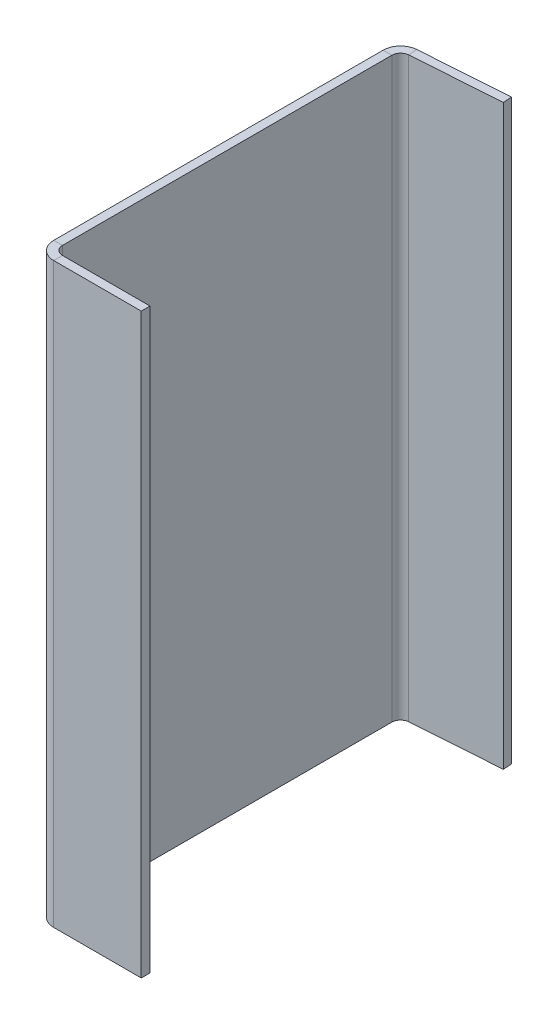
ISO-10303-21;
HEADER;
FILE_DESCRIPTION(('STEP AP214'),'2;1');
FILE_NAME('part.step','',(''),(''),'','','');
FILE_SCHEMA(('AUTOMOTIVE_DESIGN { 1 0 10303 214 1 1 1 1 }'));
ENDSEC;
DATA;
#1=APPLICATION_CONTEXT('core data for automotive mechanical design processes');
#2=APPLICATION_PROTOCOL_DEFINITION('international standard','automotive_design',2000,#1);
#3=PRODUCT_CONTEXT('',#1,'mechanical');
#4=PRODUCT('Part','Part','',(#3));
#5=PRODUCT_RELATED_PRODUCT_CATEGORY('part','',(#4));
#6=PRODUCT_DEFINITION_FORMATION('','',#4);
#7=PRODUCT_DEFINITION_CONTEXT('part definition',#1,'design');
#8=PRODUCT_DEFINITION('design','',#6,#7);
#9=PRODUCT_DEFINITION_SHAPE('','',#8);
#10=(LENGTH_UNIT() NAMED_UNIT(*) SI_UNIT(.MILLI.,.METRE.));
#11=(NAMED_UNIT(*) PLANE_ANGLE_UNIT() SI_UNIT($,.RADIAN.));
#12=(NAMED_UNIT(*) SI_UNIT($,.STERADIAN.) SOLID_ANGLE_UNIT());
#13=UNCERTAINTY_MEASURE_WITH_UNIT(LENGTH_MEASURE(1.E-05),#10,'distance_accuracy_value','');
#14=(GEOMETRIC_REPRESENTATION_CONTEXT(3) GLOBAL_UNCERTAINTY_ASSIGNED_CONTEXT((#13)) GLOBAL_UNIT_ASSIGNED_CONTEXT((#10,
#11,#12)) REPRESENTATION_CONTEXT('',''));
#15=CARTESIAN_POINT('',(0.,0.,0.));
#16=DIRECTION('',(0.,0.,1.));
#17=DIRECTION('',(1.,0.,0.));
#18=AXIS2_PLACEMENT_3D('',#15,#16,#17);
#19=CARTESIAN_POINT('',(0.,419.1,-12.7));
#20=DIRECTION('',(0.,1.,0.));
#21=DIRECTION('',(0.,0.,1.));
#22=AXIS2_PLACEMENT_3D('',#19,#20,#21);
#23=PLANE('',#22);
#24=DIRECTION('',(1.,0.,0.));
#25=VECTOR('',#24,1.);
#26=CARTESIAN_POINT('',(0.,419.1,-12.7));
#27=LINE('',#26,#25);
#28=CARTESIAN_POINT('',(0.,419.1,-12.7));
#29=VERTEX_POINT('',#28);
#30=CARTESIAN_POINT('',(6.34999999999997,419.1,-12.7));
#31=VERTEX_POINT('',#30);
#32=EDGE_CURVE('E11',#29,#31,#27,.T.);
#33=ORIENTED_EDGE('',*,*,#32,.F.);
#34=CARTESIAN_POINT('',(12.6999999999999,419.1,-12.7));
#35=DIRECTION('',(0.,1.,0.));
#36=DIRECTION('',(0.,0.,1.));
#37=AXIS2_PLACEMENT_3D('',#34,#35,#36);
#38=CIRCLE('',#37,12.7);
#39=CARTESIAN_POINT('',(12.7,419.1,0.));
#40=VERTEX_POINT('',#39);
#41=EDGE_CURVE('E246',#40,#29,#38,.F.);
#42=ORIENTED_EDGE('',*,*,#41,.F.);
#43=DIRECTION('',(0.,0.,1.));
#44=VECTOR('',#43,1.);
#45=CARTESIAN_POINT('',(12.7,419.1,-6.34999999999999));
#46=LINE('',#45,#44);
#47=CARTESIAN_POINT('',(12.7,419.1,-6.34999999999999));
#48=VERTEX_POINT('',#47);
#49=EDGE_CURVE('E44',#48,#40,#46,.T.);
#50=ORIENTED_EDGE('',*,*,#49,.F.);
#51=CARTESIAN_POINT('',(12.6999999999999,419.1,-12.7));
#52=DIRECTION('',(0.,1.,0.));
#53=DIRECTION('',(1.,0.,0.));
#54=AXIS2_PLACEMENT_3D('',#51,#52,#53);
#55=CIRCLE('',#54,6.35);
#56=EDGE_CURVE('E145',#48,#31,#55,.F.);
#57=ORIENTED_EDGE('',*,*,#56,.T.);
#58=EDGE_LOOP('',(#33,#42,#50,#57));
#59=FACE_BOUND('',#58,.T.);
#60=ADVANCED_FACE('F36',(#59),#23,.T.);
#61=CARTESIAN_POINT('',(12.7,419.1,-6.34999999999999));
#62=DIRECTION('',(0.,1.,0.));
#63=DIRECTION('',(0.,0.,1.));
#64=AXIS2_PLACEMENT_3D('',#61,#62,#63);
#65=PLANE('',#64);
#66=DIRECTION('',(0.,0.,-1.));
#67=VECTOR('',#66,1.);
#68=CARTESIAN_POINT('',(0.,419.1,0.));
#69=LINE('',#68,#67);
#70=CARTESIAN_POINT('',(0.,419.1,-251.682058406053));
#71=VERTEX_POINT('',#70);
#72=EDGE_CURVE('E139',#29,#71,#69,.T.);
#73=ORIENTED_EDGE('',*,*,#72,.F.);
#74=ORIENTED_EDGE('',*,*,#32,.T.);
#75=DIRECTION('',(0.,0.,-1.));
#76=VECTOR('',#75,1.);
#77=CARTESIAN_POINT('',(6.34999999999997,419.1,0.));
#78=LINE('',#77,#76);
#79=CARTESIAN_POINT('',(6.34999999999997,419.1,-251.682058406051));
#80=VERTEX_POINT('',#79);
#81=EDGE_CURVE('E136',#31,#80,#78,.T.);
#82=ORIENTED_EDGE('',*,*,#81,.T.);
#83=DIRECTION('',(-1.,0.,0.));
#84=VECTOR('',#83,1.);
#85=CARTESIAN_POINT('',(6.34999999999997,419.1,-251.682058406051));
#86=LINE('',#85,#84);
#87=EDGE_CURVE('E227',#80,#71,#86,.T.);
#88=ORIENTED_EDGE('',*,*,#87,.T.);
#89=EDGE_LOOP('',(#73,#74,#82,#88));
#90=FACE_BOUND('',#89,.T.);
#91=ADVANCED_FACE('F134',(#90),#65,.T.);
#92=CARTESIAN_POINT('',(12.7,0.,0.));
#93=DIRECTION('',(0.,-1.,0.));
#94=DIRECTION('',(0.,0.,-1.));
#95=AXIS2_PLACEMENT_3D('',#92,#93,#94);
#96=PLANE('',#95);
#97=DIRECTION('',(0.,0.,-1.));
#98=VECTOR('',#97,1.);
#99=CARTESIAN_POINT('',(12.7,0.,0.));
#100=LINE('',#99,#98);
#101=CARTESIAN_POINT('',(12.7,0.,0.));
#102=VERTEX_POINT('',#101);
#103=CARTESIAN_POINT('',(12.7,0.,-6.35000000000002));
#104=VERTEX_POINT('',#103);
#105=EDGE_CURVE('E232',#102,#104,#100,.T.);
#106=ORIENTED_EDGE('',*,*,#105,.F.);
#107=CARTESIAN_POINT('',(12.6999999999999,0.,-12.7));
#108=DIRECTION('',(0.,1.,0.));
#109=DIRECTION('',(0.,0.,1.));
#110=AXIS2_PLACEMENT_3D('',#107,#108,#109);
#111=CIRCLE('',#110,12.7);
#112=CARTESIAN_POINT('',(0.,0.,-12.7));
#113=VERTEX_POINT('',#112);
#114=EDGE_CURVE('E184',#102,#113,#111,.F.);
#115=ORIENTED_EDGE('',*,*,#114,.T.);
#116=DIRECTION('',(-1.,0.,0.));
#117=VECTOR('',#116,1.);
#118=CARTESIAN_POINT('',(6.34999999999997,0.,-12.7));
#119=LINE('',#118,#117);
#120=CARTESIAN_POINT('',(6.34999999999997,0.,-12.7));
#121=VERTEX_POINT('',#120);
#122=EDGE_CURVE('E230',#121,#113,#119,.T.);
#123=ORIENTED_EDGE('',*,*,#122,.F.);
#124=CARTESIAN_POINT('',(12.6999999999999,0.,-12.7));
#125=DIRECTION('',(0.,1.,0.));
#126=DIRECTION('',(1.,0.,0.));
#127=AXIS2_PLACEMENT_3D('',#124,#125,#126);
#128=CIRCLE('',#127,6.35);
#129=EDGE_CURVE('E157',#104,#121,#128,.F.);
#130=ORIENTED_EDGE('',*,*,#129,.F.);
#131=EDGE_LOOP('',(#106,#115,#123,#130));
#132=FACE_BOUND('',#131,.T.);
#133=ADVANCED_FACE('F284',(#132),#96,.T.);
#134=CARTESIAN_POINT('',(6.34999999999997,0.,-12.7));
#135=DIRECTION('',(0.,-1.,0.));
#136=DIRECTION('',(0.,0.,-1.));
#137=AXIS2_PLACEMENT_3D('',#134,#135,#136);
#138=PLANE('',#137);
#139=DIRECTION('',(-1.,0.,0.));
#140=VECTOR('',#139,1.);
#141=CARTESIAN_POINT('',(76.2,0.,0.));
#142=LINE('',#141,#140);
#143=CARTESIAN_POINT('',(76.2,0.,0.));
#144=VERTEX_POINT('',#143);
#145=EDGE_CURVE('E187',#144,#102,#142,.T.);
#146=ORIENTED_EDGE('',*,*,#145,.T.);
#147=ORIENTED_EDGE('',*,*,#105,.T.);
#148=DIRECTION('',(-1.,0.,0.));
#149=VECTOR('',#148,1.);
#150=CARTESIAN_POINT('',(76.1999999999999,0.,-6.35000000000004));
#151=LINE('',#150,#149);
#152=CARTESIAN_POINT('',(76.1999999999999,0.,-6.35000000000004));
#153=VERTEX_POINT('',#152);
#154=EDGE_CURVE('E193',#153,#104,#151,.T.);
#155=ORIENTED_EDGE('',*,*,#154,.F.);
#156=DIRECTION('',(0.,0.,1.));
#157=VECTOR('',#156,1.);
#158=CARTESIAN_POINT('',(76.1999999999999,0.,-6.35000000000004));
#159=LINE('',#158,#157);
#160=EDGE_CURVE('E190',#153,#144,#159,.T.);
#161=ORIENTED_EDGE('',*,*,#160,.T.);
#162=EDGE_LOOP('',(#146,#147,#155,#161));
#163=FACE_BOUND('',#162,.T.);
#164=ADVANCED_FACE('F287',(#163),#138,.T.);
#165=CARTESIAN_POINT('',(11.8140927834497,419.1,-264.351121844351));
#166=DIRECTION('',(0.,1.,0.));
#167=DIRECTION('',(0.,0.,1.));
#168=AXIS2_PLACEMENT_3D('',#165,#166,#167);
#169=PLANE('',#168);
#170=DIRECTION('',(0.0697564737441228,0.,0.997564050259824));
#171=VECTOR('',#170,1.);
#172=CARTESIAN_POINT('',(11.8140927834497,419.1,-264.351121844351));
#173=LINE('',#172,#171);
#174=CARTESIAN_POINT('',(11.8140927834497,419.1,-264.351121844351));
#175=VERTEX_POINT('',#174);
#176=CARTESIAN_POINT('',(12.2570463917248,419.1,-258.016590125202));
#177=VERTEX_POINT('',#176);
#178=EDGE_CURVE('E52',#175,#177,#173,.T.);
#179=ORIENTED_EDGE('',*,*,#178,.F.);
#180=CARTESIAN_POINT('',(12.6999999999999,419.1,-251.682058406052));
#181=DIRECTION('',(0.,1.,0.));
#182=DIRECTION('',(0.,0.,1.));
#183=AXIS2_PLACEMENT_3D('',#180,#181,#182);
#184=CIRCLE('',#183,12.7);
#185=EDGE_CURVE('E256',#71,#175,#184,.F.);
#186=ORIENTED_EDGE('',*,*,#185,.F.);
#187=ORIENTED_EDGE('',*,*,#87,.F.);
#188=CARTESIAN_POINT('',(12.6999999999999,419.1,-251.682058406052));
#189=DIRECTION('',(0.,1.,0.));
#190=DIRECTION('',(1.,0.,0.));
#191=AXIS2_PLACEMENT_3D('',#188,#189,#190);
#192=CIRCLE('',#191,6.35);
#193=EDGE_CURVE('E165',#80,#177,#192,.F.);
#194=ORIENTED_EDGE('',*,*,#193,.T.);
#195=EDGE_LOOP('',(#179,#186,#187,#194));
#196=FACE_BOUND('',#195,.T.);
#197=ADVANCED_FACE('F279',(#196),#169,.T.);
#198=CARTESIAN_POINT('',(6.34999999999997,419.1,-251.682058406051));
#199=DIRECTION('',(0.,1.,0.));
#200=DIRECTION('',(0.,0.,1.));
#201=AXIS2_PLACEMENT_3D('',#198,#199,#200);
#202=PLANE('',#201);
#203=DIRECTION('',(0.997564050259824,0.,-0.0697564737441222));
#204=VECTOR('',#203,1.);
#205=CARTESIAN_POINT('',(0.,419.1,-263.525000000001));
#206=LINE('',#205,#204);
#207=CARTESIAN_POINT('',(76.0143806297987,419.1,-268.840443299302));
#208=VERTEX_POINT('',#207);
#209=EDGE_CURVE('E259',#175,#208,#206,.T.);
#210=ORIENTED_EDGE('',*,*,#209,.F.);
#211=ORIENTED_EDGE('',*,*,#178,.T.);
#212=DIRECTION('',(0.997564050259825,0.,-0.0697564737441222));
#213=VECTOR('',#212,1.);
#214=CARTESIAN_POINT('',(0.442953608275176,419.1,-257.190468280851));
#215=LINE('',#214,#213);
#216=CARTESIAN_POINT('',(76.457334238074,419.1,-262.505911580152));
#217=VERTEX_POINT('',#216);
#218=EDGE_CURVE('E106',#177,#217,#215,.T.);
#219=ORIENTED_EDGE('',*,*,#218,.T.);
#220=DIRECTION('',(0.0697564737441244,0.,0.997564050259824));
#221=VECTOR('',#220,1.);
#222=CARTESIAN_POINT('',(76.0143806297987,419.1,-268.840443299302));
#223=LINE('',#222,#221);
#224=EDGE_CURVE('E262',#208,#217,#223,.T.);
#225=ORIENTED_EDGE('',*,*,#224,.F.);
#226=EDGE_LOOP('',(#210,#211,#219,#225));
#227=FACE_BOUND('',#226,.T.);
#228=ADVANCED_FACE('F268',(#227),#202,.T.);
#229=CARTESIAN_POINT('',(0.,0.,-251.682058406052));
#230=DIRECTION('',(0.,-1.,0.));
#231=DIRECTION('',(0.,0.,-1.));
#232=AXIS2_PLACEMENT_3D('',#229,#230,#231);
#233=PLANE('',#232);
#234=DIRECTION('',(1.,0.,0.));
#235=VECTOR('',#234,1.);
#236=CARTESIAN_POINT('',(0.,0.,-251.682058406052));
#237=LINE('',#236,#235);
#238=CARTESIAN_POINT('',(0.,0.,-251.682058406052));
#239=VERTEX_POINT('',#238);
#240=CARTESIAN_POINT('',(6.34999999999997,0.,-251.682058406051));
#241=VERTEX_POINT('',#240);
#242=EDGE_CURVE('E93',#239,#241,#237,.T.);
#243=ORIENTED_EDGE('',*,*,#242,.F.);
#244=CARTESIAN_POINT('',(12.6999999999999,0.,-251.682058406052));
#245=DIRECTION('',(0.,1.,0.));
#246=DIRECTION('',(0.,0.,1.));
#247=AXIS2_PLACEMENT_3D('',#244,#245,#246);
#248=CIRCLE('',#247,12.7);
#249=CARTESIAN_POINT('',(11.8140927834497,0.,-264.351121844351));
#250=VERTEX_POINT('',#249);
#251=EDGE_CURVE('E180',#239,#250,#248,.F.);
#252=ORIENTED_EDGE('',*,*,#251,.T.);
#253=DIRECTION('',(-0.0697564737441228,0.,-0.997564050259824));
#254=VECTOR('',#253,1.);
#255=CARTESIAN_POINT('',(12.2570463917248,0.,-258.016590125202));
#256=LINE('',#255,#254);
#257=CARTESIAN_POINT('',(12.2570463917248,0.,-258.016590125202));
#258=VERTEX_POINT('',#257);
#259=EDGE_CURVE('E100',#258,#250,#256,.T.);
#260=ORIENTED_EDGE('',*,*,#259,.F.);
#261=CARTESIAN_POINT('',(12.6999999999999,0.,-251.682058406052));
#262=DIRECTION('',(0.,1.,0.));
#263=DIRECTION('',(1.,0.,0.));
#264=AXIS2_PLACEMENT_3D('',#261,#262,#263);
#265=CIRCLE('',#264,6.35);
#266=EDGE_CURVE('E199',#241,#258,#265,.F.);
#267=ORIENTED_EDGE('',*,*,#266,.F.);
#268=EDGE_LOOP('',(#243,#252,#260,#267));
#269=FACE_BOUND('',#268,.T.);
#270=ADVANCED_FACE('F316',(#269),#233,.T.);
#271=CARTESIAN_POINT('',(12.2570463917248,0.,-258.016590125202));
#272=DIRECTION('',(0.,-1.,0.));
#273=DIRECTION('',(0.,0.,-1.));
#274=AXIS2_PLACEMENT_3D('',#271,#272,#273);
#275=PLANE('',#274);
#276=DIRECTION('',(0.,0.,-1.));
#277=VECTOR('',#276,1.);
#278=CARTESIAN_POINT('',(0.,0.,0.));
#279=LINE('',#278,#277);
#280=EDGE_CURVE('E182',#113,#239,#279,.T.);
#281=ORIENTED_EDGE('',*,*,#280,.T.);
#282=ORIENTED_EDGE('',*,*,#242,.T.);
#283=DIRECTION('',(0.,0.,-1.));
#284=VECTOR('',#283,1.);
#285=CARTESIAN_POINT('',(6.34999999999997,0.,0.));
#286=LINE('',#285,#284);
#287=EDGE_CURVE('E197',#121,#241,#286,.T.);
#288=ORIENTED_EDGE('',*,*,#287,.F.);
#289=ORIENTED_EDGE('',*,*,#122,.T.);
#290=EDGE_LOOP('',(#281,#282,#288,#289));
#291=FACE_BOUND('',#290,.T.);
#292=ADVANCED_FACE('F319',(#291),#275,.T.);
#293=CARTESIAN_POINT('',(0.442953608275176,419.1,-257.190468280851));
#294=DIRECTION('',(-0.0697564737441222,0.,-0.997564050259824));
#295=DIRECTION('',(-0.997564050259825,0.,0.0697564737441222));
#296=AXIS2_PLACEMENT_3D('',#293,#294,#295);
#297=PLANE('',#296);
#298=DIRECTION('',(0.997564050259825,0.,-0.0697564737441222));
#299=VECTOR('',#298,1.);
#300=CARTESIAN_POINT('',(0.442953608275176,0.,-257.19046828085));
#301=LINE('',#300,#299);
#302=CARTESIAN_POINT('',(76.4573342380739,0.,-262.505911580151));
#303=VERTEX_POINT('',#302);
#304=EDGE_CURVE('E171',#258,#303,#301,.T.);
#305=ORIENTED_EDGE('',*,*,#304,.T.);
#306=DIRECTION('',(0.,-1.,0.));
#307=VECTOR('',#306,1.);
#308=CARTESIAN_POINT('',(76.457334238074,419.1,-262.505911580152));
#309=LINE('',#308,#307);
#310=EDGE_CURVE('E223',#217,#303,#309,.T.);
#311=ORIENTED_EDGE('',*,*,#310,.F.);
#312=ORIENTED_EDGE('',*,*,#218,.F.);
#313=DIRECTION('',(0.,-1.,0.));
#314=VECTOR('',#313,1.);
#315=CARTESIAN_POINT('',(12.2570463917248,419.1,-258.016590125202));
#316=LINE('',#315,#314);
#317=EDGE_CURVE('E167',#177,#258,#316,.T.);
#318=ORIENTED_EDGE('',*,*,#317,.T.);
#319=EDGE_LOOP('',(#305,#311,#312,#318));
#320=FACE_BOUND('',#319,.T.);
#321=ADVANCED_FACE('F322',(#320),#297,.F.);
#322=CARTESIAN_POINT('',(76.0143806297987,419.1,-268.840443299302));
#323=DIRECTION('',(0.997564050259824,0.,-0.0697564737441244));
#324=DIRECTION('',(-0.0697564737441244,0.,-0.997564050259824));
#325=AXIS2_PLACEMENT_3D('',#322,#323,#324);
#326=PLANE('',#325);
#327=DIRECTION('',(0.0697564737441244,0.,0.997564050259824));
#328=VECTOR('',#327,1.);
#329=CARTESIAN_POINT('',(76.0143806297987,0.,-268.840443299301));
#330=LINE('',#329,#328);
#331=CARTESIAN_POINT('',(76.0143806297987,0.,-268.840443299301));
#332=VERTEX_POINT('',#331);
#333=EDGE_CURVE('E174',#332,#303,#330,.T.);
#334=ORIENTED_EDGE('',*,*,#333,.F.);
#335=DIRECTION('',(0.,-1.,0.));
#336=VECTOR('',#335,1.);
#337=CARTESIAN_POINT('',(76.0143806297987,419.1,-268.840443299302));
#338=LINE('',#337,#336);
#339=EDGE_CURVE('E221',#208,#332,#338,.T.);
#340=ORIENTED_EDGE('',*,*,#339,.F.);
#341=ORIENTED_EDGE('',*,*,#224,.T.);
#342=ORIENTED_EDGE('',*,*,#310,.T.);
#343=EDGE_LOOP('',(#334,#340,#341,#342));
#344=FACE_BOUND('',#343,.T.);
#345=ADVANCED_FACE('F267',(#344),#326,.T.);
#346=CARTESIAN_POINT('',(0.,419.1,-263.525000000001));
#347=DIRECTION('',(-0.0697564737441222,0.,-0.997564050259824));
#348=DIRECTION('',(-0.997564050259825,0.,0.0697564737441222));
#349=AXIS2_PLACEMENT_3D('',#346,#347,#348);
#350=PLANE('',#349);
#351=DIRECTION('',(0.997564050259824,0.,-0.0697564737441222));
#352=VECTOR('',#351,1.);
#353=CARTESIAN_POINT('',(0.,0.,-263.525));
#354=LINE('',#353,#352);
#355=EDGE_CURVE('E177',#250,#332,#354,.T.);
#356=ORIENTED_EDGE('',*,*,#355,.F.);
#357=DIRECTION('',(0.,-1.,0.));
#358=VECTOR('',#357,1.);
#359=CARTESIAN_POINT('',(11.8140927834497,419.1,-264.351121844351));
#360=LINE('',#359,#358);
#361=EDGE_CURVE('E218',#175,#250,#360,.T.);
#362=ORIENTED_EDGE('',*,*,#361,.F.);
#363=ORIENTED_EDGE('',*,*,#209,.T.);
#364=ORIENTED_EDGE('',*,*,#339,.T.);
#365=EDGE_LOOP('',(#356,#362,#363,#364));
#366=FACE_BOUND('',#365,.T.);
#367=ADVANCED_FACE('F272',(#366),#350,.T.);
#368=CARTESIAN_POINT('',(12.6999999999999,419.1,-251.682058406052));
#369=DIRECTION('',(0.,-1.,0.));
#370=DIRECTION('',(0.,0.,-1.));
#371=AXIS2_PLACEMENT_3D('',#368,#369,#370);
#372=CYLINDRICAL_SURFACE('',#371,12.7);
#373=ORIENTED_EDGE('',*,*,#251,.F.);
#374=DIRECTION('',(0.,-1.,0.));
#375=VECTOR('',#374,1.);
#376=CARTESIAN_POINT('',(0.,419.1,-251.682058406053));
#377=LINE('',#376,#375);
#378=EDGE_CURVE('E215',#71,#239,#377,.T.);
#379=ORIENTED_EDGE('',*,*,#378,.F.);
#380=ORIENTED_EDGE('',*,*,#185,.T.);
#381=ORIENTED_EDGE('',*,*,#361,.T.);
#382=EDGE_LOOP('',(#373,#379,#380,#381));
#383=FACE_BOUND('',#382,.T.);
#384=ADVANCED_FACE('F275',(#383),#372,.T.);
#385=CARTESIAN_POINT('',(0.,419.1,0.));
#386=DIRECTION('',(-1.,0.,0.));
#387=DIRECTION('',(0.,0.,1.));
#388=AXIS2_PLACEMENT_3D('',#385,#386,#387);
#389=PLANE('',#388);
#390=ORIENTED_EDGE('',*,*,#280,.F.);
#391=DIRECTION('',(0.,-1.,0.));
#392=VECTOR('',#391,1.);
#393=CARTESIAN_POINT('',(0.,419.1,-12.7));
#394=LINE('',#393,#392);
#395=EDGE_CURVE('E212',#29,#113,#394,.T.);
#396=ORIENTED_EDGE('',*,*,#395,.F.);
#397=ORIENTED_EDGE('',*,*,#72,.T.);
#398=ORIENTED_EDGE('',*,*,#378,.T.);
#399=EDGE_LOOP('',(#390,#396,#397,#398));
#400=FACE_BOUND('',#399,.T.);
#401=ADVANCED_FACE('F282',(#400),#389,.T.);
#402=CARTESIAN_POINT('',(12.6999999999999,419.1,-12.7));
#403=DIRECTION('',(0.,-1.,0.));
#404=DIRECTION('',(0.,0.,-1.));
#405=AXIS2_PLACEMENT_3D('',#402,#403,#404);
#406=CYLINDRICAL_SURFACE('',#405,12.7);
#407=ORIENTED_EDGE('',*,*,#114,.F.);
#408=DIRECTION('',(0.,-1.,0.));
#409=VECTOR('',#408,1.);
#410=CARTESIAN_POINT('',(12.7,419.1,0.));
#411=LINE('',#410,#409);
#412=EDGE_CURVE('E209',#40,#102,#411,.T.);
#413=ORIENTED_EDGE('',*,*,#412,.F.);
#414=ORIENTED_EDGE('',*,*,#41,.T.);
#415=ORIENTED_EDGE('',*,*,#395,.T.);
#416=EDGE_LOOP('',(#407,#413,#414,#415));
#417=FACE_BOUND('',#416,.T.);
#418=ADVANCED_FACE('F245',(#417),#406,.T.);
#419=CARTESIAN_POINT('',(76.2,419.1,0.));
#420=DIRECTION('',(0.,0.,1.));
#421=DIRECTION('',(1.,0.,0.));
#422=AXIS2_PLACEMENT_3D('',#419,#420,#421);
#423=PLANE('',#422);
#424=ORIENTED_EDGE('',*,*,#145,.F.);
#425=DIRECTION('',(0.,-1.,0.));
#426=VECTOR('',#425,1.);
#427=CARTESIAN_POINT('',(76.2,419.1,0.));
#428=LINE('',#427,#426);
#429=CARTESIAN_POINT('',(76.2,419.1,0.));
#430=VERTEX_POINT('',#429);
#431=EDGE_CURVE('E207',#430,#144,#428,.T.);
#432=ORIENTED_EDGE('',*,*,#431,.F.);
#433=DIRECTION('',(-1.,0.,0.));
#434=VECTOR('',#433,1.);
#435=CARTESIAN_POINT('',(76.2,419.1,0.));
#436=LINE('',#435,#434);
#437=EDGE_CURVE('E239',#430,#40,#436,.T.);
#438=ORIENTED_EDGE('',*,*,#437,.T.);
#439=ORIENTED_EDGE('',*,*,#412,.T.);
#440=EDGE_LOOP('',(#424,#432,#438,#439));
#441=FACE_BOUND('',#440,.T.);
#442=ADVANCED_FACE('F250',(#441),#423,.T.);
#443=CARTESIAN_POINT('',(76.2,419.1,-6.35000000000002));
#444=DIRECTION('',(1.,0.,0.));
#445=DIRECTION('',(0.,0.,-1.));
#446=AXIS2_PLACEMENT_3D('',#443,#444,#445);
#447=PLANE('',#446);
#448=ORIENTED_EDGE('',*,*,#160,.F.);
#449=DIRECTION('',(0.,-1.,0.));
#450=VECTOR('',#449,1.);
#451=CARTESIAN_POINT('',(76.2,419.1,-6.35000000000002));
#452=LINE('',#451,#450);
#453=CARTESIAN_POINT('',(76.2,419.1,-6.35000000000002));
#454=VERTEX_POINT('',#453);
#455=EDGE_CURVE('E205',#454,#153,#452,.T.);
#456=ORIENTED_EDGE('',*,*,#455,.F.);
#457=DIRECTION('',(0.,0.,1.));
#458=VECTOR('',#457,1.);
#459=CARTESIAN_POINT('',(76.2,419.1,-6.35000000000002));
#460=LINE('',#459,#458);
#461=EDGE_CURVE('E251',#454,#430,#460,.T.);
#462=ORIENTED_EDGE('',*,*,#461,.T.);
#463=ORIENTED_EDGE('',*,*,#431,.T.);
#464=EDGE_LOOP('',(#448,#456,#462,#463));
#465=FACE_BOUND('',#464,.T.);
#466=ADVANCED_FACE('F292',(#465),#447,.T.);
#467=CARTESIAN_POINT('',(76.2,419.1,-6.35000000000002));
#468=DIRECTION('',(0.,0.,1.));
#469=DIRECTION('',(1.,0.,0.));
#470=AXIS2_PLACEMENT_3D('',#467,#468,#469);
#471=PLANE('',#470);
#472=ORIENTED_EDGE('',*,*,#154,.T.);
#473=DIRECTION('',(0.,-1.,0.));
#474=VECTOR('',#473,1.);
#475=CARTESIAN_POINT('',(12.7,419.1,-6.34999999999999));
#476=LINE('',#475,#474);
#477=EDGE_CURVE('E159',#48,#104,#476,.T.);
#478=ORIENTED_EDGE('',*,*,#477,.F.);
#479=DIRECTION('',(-1.,0.,0.));
#480=VECTOR('',#479,1.);
#481=CARTESIAN_POINT('',(76.2,419.1,-6.35000000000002));
#482=LINE('',#481,#480);
#483=EDGE_CURVE('E150',#454,#48,#482,.T.);
#484=ORIENTED_EDGE('',*,*,#483,.F.);
#485=ORIENTED_EDGE('',*,*,#455,.T.);
#486=EDGE_LOOP('',(#472,#478,#484,#485));
#487=FACE_BOUND('',#486,.T.);
#488=ADVANCED_FACE('F290',(#487),#471,.F.);
#489=CARTESIAN_POINT('',(12.6999999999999,419.1,-12.7));
#490=DIRECTION('',(0.,-1.,0.));
#491=DIRECTION('',(0.,0.,-1.));
#492=AXIS2_PLACEMENT_3D('',#489,#490,#491);
#493=CYLINDRICAL_SURFACE('',#492,6.35);
#494=ORIENTED_EDGE('',*,*,#129,.T.);
#495=DIRECTION('',(0.,-1.,0.));
#496=VECTOR('',#495,1.);
#497=CARTESIAN_POINT('',(6.34999999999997,419.1,-12.7));
#498=LINE('',#497,#496);
#499=EDGE_CURVE('E154',#31,#121,#498,.T.);
#500=ORIENTED_EDGE('',*,*,#499,.F.);
#501=ORIENTED_EDGE('',*,*,#56,.F.);
#502=ORIENTED_EDGE('',*,*,#477,.T.);
#503=EDGE_LOOP('',(#494,#500,#501,#502));
#504=FACE_BOUND('',#503,.T.);
#505=ADVANCED_FACE('F155',(#504),#493,.F.);
#506=CARTESIAN_POINT('',(6.34999999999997,419.1,0.));
#507=DIRECTION('',(-1.,0.,0.));
#508=DIRECTION('',(0.,0.,1.));
#509=AXIS2_PLACEMENT_3D('',#506,#507,#508);
#510=PLANE('',#509);
#511=ORIENTED_EDGE('',*,*,#287,.T.);
#512=DIRECTION('',(0.,-1.,0.));
#513=VECTOR('',#512,1.);
#514=CARTESIAN_POINT('',(6.34999999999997,419.1,-251.682058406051));
#515=LINE('',#514,#513);
#516=EDGE_CURVE('E160',#80,#241,#515,.T.);
#517=ORIENTED_EDGE('',*,*,#516,.F.);
#518=ORIENTED_EDGE('',*,*,#81,.F.);
#519=ORIENTED_EDGE('',*,*,#499,.T.);
#520=EDGE_LOOP('',(#511,#517,#518,#519));
#521=FACE_BOUND('',#520,.T.);
#522=ADVANCED_FACE('F162',(#521),#510,.F.);
#523=CARTESIAN_POINT('',(12.6999999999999,419.1,-251.682058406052));
#524=DIRECTION('',(0.,-1.,0.));
#525=DIRECTION('',(0.,0.,-1.));
#526=AXIS2_PLACEMENT_3D('',#523,#524,#525);
#527=CYLINDRICAL_SURFACE('',#526,6.35);
#528=ORIENTED_EDGE('',*,*,#266,.T.);
#529=ORIENTED_EDGE('',*,*,#317,.F.);
#530=ORIENTED_EDGE('',*,*,#193,.F.);
#531=ORIENTED_EDGE('',*,*,#516,.T.);
#532=EDGE_LOOP('',(#528,#529,#530,#531));
#533=FACE_BOUND('',#532,.T.);
#534=ADVANCED_FACE('F374',(#533),#527,.F.);
#535=CARTESIAN_POINT('',(12.6999999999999,419.1,-251.682058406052));
#536=DIRECTION('',(0.,1.,0.));
#537=DIRECTION('',(1.,0.,0.));
#538=AXIS2_PLACEMENT_3D('',#535,#536,#537);
#539=PLANE('',#538);
#540=ORIENTED_EDGE('',*,*,#483,.T.);
#541=ORIENTED_EDGE('',*,*,#49,.T.);
#542=ORIENTED_EDGE('',*,*,#437,.F.);
#543=ORIENTED_EDGE('',*,*,#461,.F.);
#544=EDGE_LOOP('',(#540,#541,#542,#543));
#545=FACE_BOUND('',#544,.T.);
#546=ADVANCED_FACE('F236',(#545),#539,.T.);
#547=CARTESIAN_POINT('',(12.6999999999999,0.,-251.682058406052));
#548=DIRECTION('',(0.,1.,0.));
#549=DIRECTION('',(1.,0.,0.));
#550=AXIS2_PLACEMENT_3D('',#547,#548,#549);
#551=PLANE('',#550);
#552=ORIENTED_EDGE('',*,*,#304,.F.);
#553=ORIENTED_EDGE('',*,*,#259,.T.);
#554=ORIENTED_EDGE('',*,*,#355,.T.);
#555=ORIENTED_EDGE('',*,*,#333,.T.);
#556=EDGE_LOOP('',(#552,#553,#554,#555));
#557=FACE_BOUND('',#556,.T.);
#558=ADVANCED_FACE('F394',(#557),#551,.F.);
#559=CLOSED_SHELL('',(#60,#91,#133,#164,#197,#228,#270,#292,#321,#345,#367,#384,#401,#418,#442,
#466,#488,#505,#522,#534,#546,#558));
#560=MANIFOLD_SOLID_BREP('B2',#559);
#561=ADVANCED_BREP_SHAPE_REPRESENTATION('',(#18,#560),#14);
#562=SHAPE_DEFINITION_REPRESENTATION(#9,#561);
ENDSEC;
END-ISO-10303-21;
